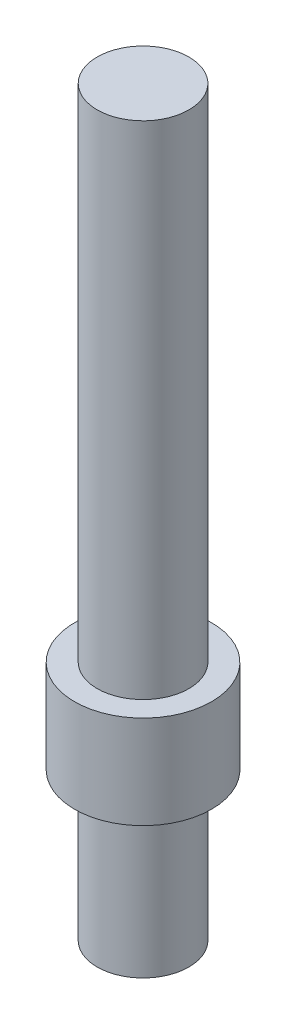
ISO-10303-21;
HEADER;
FILE_DESCRIPTION(('STEP AP214'),'2;1');
FILE_NAME('part.step','',(''),(''),'','','');
FILE_SCHEMA(('AUTOMOTIVE_DESIGN { 1 0 10303 214 1 1 1 1 }'));
ENDSEC;
DATA;
#1=APPLICATION_CONTEXT('core data for automotive mechanical design processes');
#2=APPLICATION_PROTOCOL_DEFINITION('international standard','automotive_design',2000,#1);
#3=PRODUCT_CONTEXT('',#1,'mechanical');
#4=PRODUCT('Part','Part','',(#3));
#5=PRODUCT_RELATED_PRODUCT_CATEGORY('part','',(#4));
#6=PRODUCT_DEFINITION_FORMATION('','',#4);
#7=PRODUCT_DEFINITION_CONTEXT('part definition',#1,'design');
#8=PRODUCT_DEFINITION('design','',#6,#7);
#9=PRODUCT_DEFINITION_SHAPE('','',#8);
#10=(LENGTH_UNIT() NAMED_UNIT(*) SI_UNIT(.MILLI.,.METRE.));
#11=(NAMED_UNIT(*) PLANE_ANGLE_UNIT() SI_UNIT($,.RADIAN.));
#12=(NAMED_UNIT(*) SI_UNIT($,.STERADIAN.) SOLID_ANGLE_UNIT());
#13=UNCERTAINTY_MEASURE_WITH_UNIT(LENGTH_MEASURE(1.E-05),#10,'distance_accuracy_value','');
#14=(GEOMETRIC_REPRESENTATION_CONTEXT(3) GLOBAL_UNCERTAINTY_ASSIGNED_CONTEXT((#13)) GLOBAL_UNIT_ASSIGNED_CONTEXT((#10,
#11,#12)) REPRESENTATION_CONTEXT('',''));
#15=CARTESIAN_POINT('',(0.,0.,0.));
#16=DIRECTION('',(0.,0.,1.));
#17=DIRECTION('',(1.,0.,0.));
#18=AXIS2_PLACEMENT_3D('',#15,#16,#17);
#19=CARTESIAN_POINT('',(0.,-220.4102486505,0.));
#20=DIRECTION('',(0.,-1.,0.));
#21=DIRECTION('',(1.,0.,0.));
#22=AXIS2_PLACEMENT_3D('',#19,#20,#21);
#23=PLANE('',#22);
#24=CARTESIAN_POINT('',(0.,-220.4102486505,0.));
#25=DIRECTION('',(0.,-1.,0.));
#26=DIRECTION('',(1.,0.,0.));
#27=AXIS2_PLACEMENT_3D('',#24,#25,#26);
#28=CIRCLE('',#27,25.4);
#29=CARTESIAN_POINT('',(25.4,-220.4102486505,0.));
#30=VERTEX_POINT('',#29);
#31=EDGE_CURVE('E43',#30,#30,#28,.T.);
#32=ORIENTED_EDGE('',*,*,#31,.T.);
#33=EDGE_LOOP('',(#32));
#34=FACE_BOUND('',#33,.T.);
#35=CARTESIAN_POINT('',(2.00649565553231E-13,-220.4102486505,0.));
#36=DIRECTION('',(0.,-1.,0.));
#37=DIRECTION('',(1.,0.,0.));
#38=AXIS2_PLACEMENT_3D('',#35,#36,#37);
#39=CIRCLE('',#38,16.9999999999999);
#40=CARTESIAN_POINT('',(17.0000000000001,-220.4102486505,0.));
#41=VERTEX_POINT('',#40);
#42=EDGE_CURVE('E53',#41,#41,#39,.T.);
#43=ORIENTED_EDGE('',*,*,#42,.F.);
#44=EDGE_LOOP('',(#43));
#45=FACE_BOUND('',#44,.T.);
#46=ADVANCED_FACE('F32',(#34,#45),#23,.T.);
#47=CARTESIAN_POINT('',(0.,-185.8662486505,0.));
#48=DIRECTION('',(0.,1.,0.));
#49=DIRECTION('',(0.,0.,1.));
#50=AXIS2_PLACEMENT_3D('',#47,#48,#49);
#51=CYLINDRICAL_SURFACE('',#50,17.);
#52=CARTESIAN_POINT('',(0.,-185.8662486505,0.));
#53=DIRECTION('',(0.,-1.,0.));
#54=DIRECTION('',(1.,0.,0.));
#55=AXIS2_PLACEMENT_3D('',#52,#53,#54);
#56=CIRCLE('',#55,17.);
#57=CARTESIAN_POINT('',(17.,-185.8662486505,0.));
#58=VERTEX_POINT('',#57);
#59=EDGE_CURVE('E39',#58,#58,#56,.F.);
#60=ORIENTED_EDGE('',*,*,#59,.T.);
#61=EDGE_LOOP('',(#60));
#62=FACE_BOUND('',#61,.T.);
#63=CARTESIAN_POINT('',(0.,0.,0.));
#64=DIRECTION('',(0.,1.,0.));
#65=DIRECTION('',(0.,0.,-1.));
#66=AXIS2_PLACEMENT_3D('',#63,#64,#65);
#67=CIRCLE('',#66,17.);
#68=CARTESIAN_POINT('',(0.,0.,-17.));
#69=VERTEX_POINT('',#68);
#70=EDGE_CURVE('E10',#69,#69,#67,.T.);
#71=ORIENTED_EDGE('',*,*,#70,.F.);
#72=EDGE_LOOP('',(#71));
#73=FACE_BOUND('',#72,.T.);
#74=ADVANCED_FACE('F34',(#62,#73),#51,.T.);
#75=CARTESIAN_POINT('',(0.,0.,0.));
#76=DIRECTION('',(0.,-1.,0.));
#77=DIRECTION('',(0.,0.,-1.));
#78=AXIS2_PLACEMENT_3D('',#75,#76,#77);
#79=PLANE('',#78);
#80=ORIENTED_EDGE('',*,*,#70,.T.);
#81=EDGE_LOOP('',(#80));
#82=FACE_BOUND('',#81,.T.);
#83=ADVANCED_FACE('F105',(#82),#79,.F.);
#84=CARTESIAN_POINT('',(0.,-220.4102486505,0.));
#85=DIRECTION('',(0.,1.,0.));
#86=DIRECTION('',(-1.,0.,0.));
#87=AXIS2_PLACEMENT_3D('',#84,#85,#86);
#88=CYLINDRICAL_SURFACE('',#87,25.4);
#89=ORIENTED_EDGE('',*,*,#31,.F.);
#90=EDGE_LOOP('',(#89));
#91=FACE_BOUND('',#90,.T.);
#92=CARTESIAN_POINT('',(0.,-185.8662486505,0.));
#93=DIRECTION('',(0.,-1.,0.));
#94=DIRECTION('',(1.,0.,0.));
#95=AXIS2_PLACEMENT_3D('',#92,#93,#94);
#96=CIRCLE('',#95,25.4);
#97=CARTESIAN_POINT('',(25.4,-185.8662486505,0.));
#98=VERTEX_POINT('',#97);
#99=EDGE_CURVE('E47',#98,#98,#96,.T.);
#100=ORIENTED_EDGE('',*,*,#99,.T.);
#101=EDGE_LOOP('',(#100));
#102=FACE_BOUND('',#101,.T.);
#103=ADVANCED_FACE('F113',(#91,#102),#88,.T.);
#104=CARTESIAN_POINT('',(0.,-185.8662486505,0.));
#105=DIRECTION('',(0.,-1.,0.));
#106=DIRECTION('',(1.,0.,0.));
#107=AXIS2_PLACEMENT_3D('',#104,#105,#106);
#108=PLANE('',#107);
#109=ORIENTED_EDGE('',*,*,#59,.F.);
#110=EDGE_LOOP('',(#109));
#111=FACE_BOUND('',#110,.T.);
#112=ORIENTED_EDGE('',*,*,#99,.F.);
#113=EDGE_LOOP('',(#112));
#114=FACE_BOUND('',#113,.T.);
#115=ADVANCED_FACE('F110',(#111,#114),#108,.F.);
#116=CARTESIAN_POINT('',(2.07890408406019E-13,-275.2742486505,0.));
#117=DIRECTION('',(0.,1.,0.));
#118=DIRECTION('',(-1.,0.,0.));
#119=AXIS2_PLACEMENT_3D('',#116,#117,#118);
#120=CYLINDRICAL_SURFACE('',#119,16.9999999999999);
#121=CARTESIAN_POINT('',(2.07890408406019E-13,-275.2742486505,0.));
#122=DIRECTION('',(0.,-1.,0.));
#123=DIRECTION('',(1.,0.,0.));
#124=AXIS2_PLACEMENT_3D('',#121,#122,#123);
#125=CIRCLE('',#124,16.9999999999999);
#126=CARTESIAN_POINT('',(17.0000000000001,-275.2742486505,0.));
#127=VERTEX_POINT('',#126);
#128=EDGE_CURVE('E51',#127,#127,#125,.T.);
#129=ORIENTED_EDGE('',*,*,#128,.F.);
#130=EDGE_LOOP('',(#129));
#131=FACE_BOUND('',#130,.T.);
#132=ORIENTED_EDGE('',*,*,#42,.T.);
#133=EDGE_LOOP('',(#132));
#134=FACE_BOUND('',#133,.T.);
#135=ADVANCED_FACE('F109',(#131,#134),#120,.T.);
#136=CARTESIAN_POINT('',(2.07890408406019E-13,-275.2742486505,0.));
#137=DIRECTION('',(0.,-1.,0.));
#138=DIRECTION('',(1.,0.,0.));
#139=AXIS2_PLACEMENT_3D('',#136,#137,#138);
#140=PLANE('',#139);
#141=CARTESIAN_POINT('',(2.07890408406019E-13,-275.2742486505,0.));
#142=DIRECTION('',(0.,-1.,0.));
#143=DIRECTION('',(1.,0.,0.));
#144=AXIS2_PLACEMENT_3D('',#141,#142,#143);
#145=CIRCLE('',#144,14.4599999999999);
#146=CARTESIAN_POINT('',(14.4600000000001,-275.2742486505,0.));
#147=VERTEX_POINT('',#146);
#148=EDGE_CURVE('E59',#147,#147,#145,.T.);
#149=ORIENTED_EDGE('',*,*,#148,.F.);
#150=EDGE_LOOP('',(#149));
#151=FACE_BOUND('',#150,.T.);
#152=ORIENTED_EDGE('',*,*,#128,.T.);
#153=EDGE_LOOP('',(#152));
#154=FACE_BOUND('',#153,.T.);
#155=ADVANCED_FACE('F84',(#151,#154),#140,.T.);
#156=CARTESIAN_POINT('',(0.,-217.8702486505,0.));
#157=DIRECTION('',(0.,-1.,0.));
#158=DIRECTION('',(1.,0.,0.));
#159=AXIS2_PLACEMENT_3D('',#156,#157,#158);
#160=PLANE('',#159);
#161=CARTESIAN_POINT('',(0.,-217.8702486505,0.));
#162=DIRECTION('',(0.,-1.,0.));
#163=DIRECTION('',(1.,0.,0.));
#164=AXIS2_PLACEMENT_3D('',#161,#162,#163);
#165=CIRCLE('',#164,22.86);
#166=CARTESIAN_POINT('',(22.86,-217.8702486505,0.));
#167=VERTEX_POINT('',#166);
#168=EDGE_CURVE('E69',#167,#167,#165,.T.);
#169=ORIENTED_EDGE('',*,*,#168,.F.);
#170=EDGE_LOOP('',(#169));
#171=FACE_BOUND('',#170,.T.);
#172=CARTESIAN_POINT('',(2.00314341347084E-13,-217.8702486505,0.));
#173=DIRECTION('',(0.,-1.,0.));
#174=DIRECTION('',(1.,0.,0.));
#175=AXIS2_PLACEMENT_3D('',#172,#173,#174);
#176=CIRCLE('',#175,14.4599999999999);
#177=CARTESIAN_POINT('',(14.4600000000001,-217.8702486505,0.));
#178=VERTEX_POINT('',#177);
#179=EDGE_CURVE('E63',#178,#178,#176,.T.);
#180=ORIENTED_EDGE('',*,*,#179,.T.);
#181=EDGE_LOOP('',(#180));
#182=FACE_BOUND('',#181,.T.);
#183=ADVANCED_FACE('F80',(#171,#182),#160,.F.);
#184=CARTESIAN_POINT('',(0.,-185.8662486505,0.));
#185=DIRECTION('',(0.,1.,0.));
#186=DIRECTION('',(0.,0.,1.));
#187=AXIS2_PLACEMENT_3D('',#184,#185,#186);
#188=CYLINDRICAL_SURFACE('',#187,14.46);
#189=CARTESIAN_POINT('',(0.,-188.4062486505,0.));
#190=DIRECTION('',(0.,-1.,0.));
#191=DIRECTION('',(1.,0.,0.));
#192=AXIS2_PLACEMENT_3D('',#189,#190,#191);
#193=CIRCLE('',#192,14.46);
#194=CARTESIAN_POINT('',(14.46,-188.4062486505,0.));
#195=VERTEX_POINT('',#194);
#196=EDGE_CURVE('E66',#195,#195,#193,.F.);
#197=ORIENTED_EDGE('',*,*,#196,.F.);
#198=EDGE_LOOP('',(#197));
#199=FACE_BOUND('',#198,.T.);
#200=CARTESIAN_POINT('',(0.,-2.54000000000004,0.));
#201=DIRECTION('',(0.,-1.,0.));
#202=DIRECTION('',(0.,0.,-1.));
#203=AXIS2_PLACEMENT_3D('',#200,#201,#202);
#204=CIRCLE('',#203,14.46);
#205=CARTESIAN_POINT('',(0.,-2.54000000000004,-14.46));
#206=VERTEX_POINT('',#205);
#207=EDGE_CURVE('E56',#206,#206,#204,.F.);
#208=ORIENTED_EDGE('',*,*,#207,.T.);
#209=EDGE_LOOP('',(#208));
#210=FACE_BOUND('',#209,.T.);
#211=ADVANCED_FACE('F83',(#199,#210),#188,.F.);
#212=CARTESIAN_POINT('',(0.,-2.54000000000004,0.));
#213=DIRECTION('',(0.,-1.,0.));
#214=DIRECTION('',(0.,0.,-1.));
#215=AXIS2_PLACEMENT_3D('',#212,#213,#214);
#216=PLANE('',#215);
#217=ORIENTED_EDGE('',*,*,#207,.F.);
#218=EDGE_LOOP('',(#217));
#219=FACE_BOUND('',#218,.T.);
#220=ADVANCED_FACE('F152',(#219),#216,.T.);
#221=CARTESIAN_POINT('',(0.,-220.4102486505,0.));
#222=DIRECTION('',(0.,1.,0.));
#223=DIRECTION('',(-1.,0.,0.));
#224=AXIS2_PLACEMENT_3D('',#221,#222,#223);
#225=CYLINDRICAL_SURFACE('',#224,22.86);
#226=ORIENTED_EDGE('',*,*,#168,.T.);
#227=EDGE_LOOP('',(#226));
#228=FACE_BOUND('',#227,.T.);
#229=CARTESIAN_POINT('',(0.,-188.4062486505,0.));
#230=DIRECTION('',(0.,-1.,0.));
#231=DIRECTION('',(1.,0.,0.));
#232=AXIS2_PLACEMENT_3D('',#229,#230,#231);
#233=CIRCLE('',#232,22.86);
#234=CARTESIAN_POINT('',(22.86,-188.4062486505,0.));
#235=VERTEX_POINT('',#234);
#236=EDGE_CURVE('E62',#235,#235,#233,.T.);
#237=ORIENTED_EDGE('',*,*,#236,.F.);
#238=EDGE_LOOP('',(#237));
#239=FACE_BOUND('',#238,.T.);
#240=ADVANCED_FACE('F77',(#228,#239),#225,.F.);
#241=CARTESIAN_POINT('',(0.,-188.4062486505,0.));
#242=DIRECTION('',(0.,-1.,0.));
#243=DIRECTION('',(1.,0.,0.));
#244=AXIS2_PLACEMENT_3D('',#241,#242,#243);
#245=PLANE('',#244);
#246=ORIENTED_EDGE('',*,*,#196,.T.);
#247=EDGE_LOOP('',(#246));
#248=FACE_BOUND('',#247,.T.);
#249=ORIENTED_EDGE('',*,*,#236,.T.);
#250=EDGE_LOOP('',(#249));
#251=FACE_BOUND('',#250,.T.);
#252=ADVANCED_FACE('F90',(#248,#251),#245,.T.);
#253=CARTESIAN_POINT('',(2.07890408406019E-13,-275.2742486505,0.));
#254=DIRECTION('',(0.,1.,0.));
#255=DIRECTION('',(-1.,0.,0.));
#256=AXIS2_PLACEMENT_3D('',#253,#254,#255);
#257=CYLINDRICAL_SURFACE('',#256,14.4599999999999);
#258=ORIENTED_EDGE('',*,*,#148,.T.);
#259=EDGE_LOOP('',(#258));
#260=FACE_BOUND('',#259,.T.);
#261=ORIENTED_EDGE('',*,*,#179,.F.);
#262=EDGE_LOOP('',(#261));
#263=FACE_BOUND('',#262,.T.);
#264=ADVANCED_FACE('F88',(#260,#263),#257,.F.);
#265=CLOSED_SHELL('',(#46,#74,#83,#103,#115,#135,#155,#183,#211,#220,#240,#252,#264));
#266=MANIFOLD_SOLID_BREP('B2',#265);
#267=ADVANCED_BREP_SHAPE_REPRESENTATION('',(#18,#266),#14);
#268=SHAPE_DEFINITION_REPRESENTATION(#9,#267);
ENDSEC;
END-ISO-10303-21;
